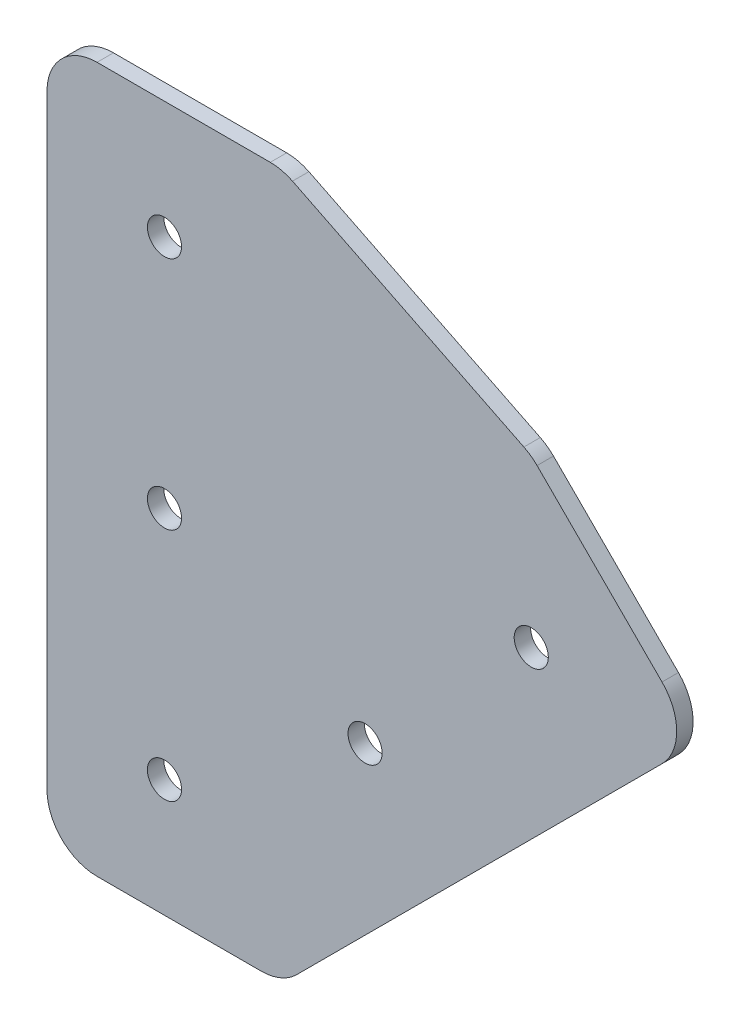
ISO-10303-21;
HEADER;
FILE_DESCRIPTION(('STEP AP214'),'2;1');
FILE_NAME('part.step','',(''),(''),'','','');
FILE_SCHEMA(('AUTOMOTIVE_DESIGN { 1 0 10303 214 1 1 1 1 }'));
ENDSEC;
DATA;
#1=APPLICATION_CONTEXT('core data for automotive mechanical design processes');
#2=APPLICATION_PROTOCOL_DEFINITION('international standard','automotive_design',2000,#1);
#3=PRODUCT_CONTEXT('',#1,'mechanical');
#4=PRODUCT('Part','Part','',(#3));
#5=PRODUCT_RELATED_PRODUCT_CATEGORY('part','',(#4));
#6=PRODUCT_DEFINITION_FORMATION('','',#4);
#7=PRODUCT_DEFINITION_CONTEXT('part definition',#1,'design');
#8=PRODUCT_DEFINITION('design','',#6,#7);
#9=PRODUCT_DEFINITION_SHAPE('','',#8);
#10=(LENGTH_UNIT() NAMED_UNIT(*) SI_UNIT(.MILLI.,.METRE.));
#11=(NAMED_UNIT(*) PLANE_ANGLE_UNIT() SI_UNIT($,.RADIAN.));
#12=(NAMED_UNIT(*) SI_UNIT($,.STERADIAN.) SOLID_ANGLE_UNIT());
#13=UNCERTAINTY_MEASURE_WITH_UNIT(LENGTH_MEASURE(1.E-05),#10,'distance_accuracy_value','');
#14=(GEOMETRIC_REPRESENTATION_CONTEXT(3) GLOBAL_UNCERTAINTY_ASSIGNED_CONTEXT((#13)) GLOBAL_UNIT_ASSIGNED_CONTEXT((#10,
#11,#12)) REPRESENTATION_CONTEXT('',''));
#15=CARTESIAN_POINT('',(0.,0.,0.));
#16=DIRECTION('',(0.,0.,1.));
#17=DIRECTION('',(1.,0.,0.));
#18=AXIS2_PLACEMENT_3D('',#15,#16,#17);
#19=CARTESIAN_POINT('',(0.,0.,1.5875));
#20=DIRECTION('',(0.,0.,1.));
#21=DIRECTION('',(1.,0.,0.));
#22=AXIS2_PLACEMENT_3D('',#19,#20,#21);
#23=PLANE('',#22);
#24=DIRECTION('',(-0.707106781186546,-0.707106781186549,0.));
#25=VECTOR('',#24,1.);
#26=CARTESIAN_POINT('',(22.733,0.,1.5875));
#27=LINE('',#26,#25);
#28=CARTESIAN_POINT('',(24.1511523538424,1.41815235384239,1.5875));
#29=VERTEX_POINT('',#28);
#30=CARTESIAN_POINT('',(59.4959234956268,36.7629234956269,1.5875));
#31=VERTEX_POINT('',#30);
#32=EDGE_CURVE('E139',#29,#31,#27,.F.);
#33=ORIENTED_EDGE('',*,*,#32,.T.);
#34=CARTESIAN_POINT('',(56.0722008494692,40.1866461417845,1.5875));
#35=DIRECTION('',(0.,0.,-1.));
#36=DIRECTION('',(-1.,0.,0.));
#37=AXIS2_PLACEMENT_3D('',#34,#35,#36);
#38=CIRCLE('',#37,4.841875);
#39=CARTESIAN_POINT('',(59.4959234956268,43.6103687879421,1.5875));
#40=VERTEX_POINT('',#39);
#41=EDGE_CURVE('E141',#40,#31,#38,.T.);
#42=ORIENTED_EDGE('',*,*,#41,.F.);
#43=DIRECTION('',(0.707106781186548,-0.707106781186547,0.));
#44=VECTOR('',#43,1.);
#45=CARTESIAN_POINT('',(62.9196461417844,40.1866461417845,1.5875));
#46=LINE('',#45,#44);
#47=CARTESIAN_POINT('',(47.4074930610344,55.6987992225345,1.5875));
#48=VERTEX_POINT('',#47);
#49=EDGE_CURVE('E134',#40,#48,#46,.F.);
#50=ORIENTED_EDGE('',*,*,#49,.T.);
#51=CARTESIAN_POINT('',(43.9837704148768,52.2750765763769,1.5875));
#52=DIRECTION('',(0.,0.,-1.));
#53=DIRECTION('',(-1.,0.,0.));
#54=AXIS2_PLACEMENT_3D('',#51,#52,#53);
#55=CIRCLE('',#54,4.841875);
#56=CARTESIAN_POINT('',(46.1320748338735,56.6142633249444,1.5875));
#57=VERTEX_POINT('',#56);
#58=EDGE_CURVE('E137',#57,#48,#55,.T.);
#59=ORIENTED_EDGE('',*,*,#58,.F.);
#60=DIRECTION('',(0.896179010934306,-0.443692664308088,0.));
#61=VECTOR('',#60,1.);
#62=CARTESIAN_POINT('',(22.733,68.199,1.5875));
#63=LINE('',#62,#61);
#64=CARTESIAN_POINT('',(23.7483394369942,67.6963117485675,1.5875));
#65=VERTEX_POINT('',#64);
#66=EDGE_CURVE('E110',#57,#65,#63,.F.);
#67=ORIENTED_EDGE('',*,*,#66,.T.);
#68=CARTESIAN_POINT('',(21.6000350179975,63.357125,1.5875));
#69=DIRECTION('',(0.,0.,-1.));
#70=DIRECTION('',(-1.,0.,0.));
#71=AXIS2_PLACEMENT_3D('',#68,#69,#70);
#72=CIRCLE('',#71,4.841875);
#73=CARTESIAN_POINT('',(21.6000350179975,68.199,1.5875));
#74=VERTEX_POINT('',#73);
#75=EDGE_CURVE('E104',#74,#65,#72,.T.);
#76=ORIENTED_EDGE('',*,*,#75,.F.);
#77=DIRECTION('',(1.,0.,0.));
#78=VECTOR('',#77,1.);
#79=CARTESIAN_POINT('',(0.,68.199,1.5875));
#80=LINE('',#79,#78);
#81=CARTESIAN_POINT('',(4.841875,68.199,1.5875));
#82=VERTEX_POINT('',#81);
#83=EDGE_CURVE('E108',#74,#82,#80,.F.);
#84=ORIENTED_EDGE('',*,*,#83,.T.);
#85=CARTESIAN_POINT('',(4.841875,63.357125,1.5875));
#86=DIRECTION('',(0.,0.,-1.));
#87=DIRECTION('',(-1.,0.,0.));
#88=AXIS2_PLACEMENT_3D('',#85,#86,#87);
#89=CIRCLE('',#88,4.841875);
#90=CARTESIAN_POINT('',(0.,63.357125,1.5875));
#91=VERTEX_POINT('',#90);
#92=EDGE_CURVE('E123',#91,#82,#89,.T.);
#93=ORIENTED_EDGE('',*,*,#92,.F.);
#94=DIRECTION('',(0.,1.,0.));
#95=VECTOR('',#94,1.);
#96=CARTESIAN_POINT('',(0.,68.199,1.5875));
#97=LINE('',#96,#95);
#98=CARTESIAN_POINT('',(0.,4.841875,1.5875));
#99=VERTEX_POINT('',#98);
#100=EDGE_CURVE('E148',#91,#99,#97,.F.);
#101=ORIENTED_EDGE('',*,*,#100,.T.);
#102=CARTESIAN_POINT('',(4.841875,4.841875,1.5875));
#103=DIRECTION('',(0.,0.,-1.));
#104=DIRECTION('',(-1.,0.,0.));
#105=AXIS2_PLACEMENT_3D('',#102,#103,#104);
#106=CIRCLE('',#105,4.841875);
#107=CARTESIAN_POINT('',(4.841875,0.,1.5875));
#108=VERTEX_POINT('',#107);
#109=EDGE_CURVE('E150',#108,#99,#106,.T.);
#110=ORIENTED_EDGE('',*,*,#109,.F.);
#111=DIRECTION('',(1.,0.,0.));
#112=VECTOR('',#111,1.);
#113=CARTESIAN_POINT('',(0.,0.,1.5875));
#114=LINE('',#113,#112);
#115=CARTESIAN_POINT('',(20.7274297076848,0.,1.5875));
#116=VERTEX_POINT('',#115);
#117=EDGE_CURVE('E143',#108,#116,#114,.T.);
#118=ORIENTED_EDGE('',*,*,#117,.T.);
#119=CARTESIAN_POINT('',(20.7274297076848,4.841875,1.5875));
#120=DIRECTION('',(0.,0.,-1.));
#121=DIRECTION('',(-1.,0.,0.));
#122=AXIS2_PLACEMENT_3D('',#119,#120,#121);
#123=CIRCLE('',#122,4.841875);
#124=EDGE_CURVE('E146',#29,#116,#123,.T.);
#125=ORIENTED_EDGE('',*,*,#124,.F.);
#126=EDGE_LOOP('',(#33,#42,#50,#59,#67,#76,#84,#93,#101,#110,#118,#125));
#127=FACE_BOUND('',#126,.T.);
#128=CARTESIAN_POINT('',(11.3665,34.0995,1.5875));
#129=DIRECTION('',(0.,0.,1.));
#130=DIRECTION('',(1.,0.,0.));
#131=AXIS2_PLACEMENT_3D('',#128,#129,#130);
#132=CIRCLE('',#131,1.651);
#133=CARTESIAN_POINT('',(13.0175,34.0995,1.5875));
#134=VERTEX_POINT('',#133);
#135=EDGE_CURVE('E116',#134,#134,#132,.F.);
#136=ORIENTED_EDGE('',*,*,#135,.T.);
#137=EDGE_LOOP('',(#136));
#138=FACE_BOUND('',#137,.T.);
#139=CARTESIAN_POINT('',(11.3665,11.3665,1.5875));
#140=DIRECTION('',(0.,0.,1.));
#141=DIRECTION('',(1.,0.,0.));
#142=AXIS2_PLACEMENT_3D('',#139,#140,#141);
#143=CIRCLE('',#142,1.651);
#144=CARTESIAN_POINT('',(13.0175,11.3665,1.5875));
#145=VERTEX_POINT('',#144);
#146=EDGE_CURVE('E198',#145,#145,#143,.F.);
#147=ORIENTED_EDGE('',*,*,#146,.T.);
#148=EDGE_LOOP('',(#147));
#149=FACE_BOUND('',#148,.T.);
#150=CARTESIAN_POINT('',(30.7703292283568,24.1119876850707,1.5875));
#151=DIRECTION('',(0.,0.,1.));
#152=DIRECTION('',(1.,0.,0.));
#153=AXIS2_PLACEMENT_3D('',#150,#151,#152);
#154=CIRCLE('',#153,1.651);
#155=CARTESIAN_POINT('',(32.4213292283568,24.1119876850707,1.5875));
#156=VERTEX_POINT('',#155);
#157=EDGE_CURVE('E201',#156,#156,#154,.F.);
#158=ORIENTED_EDGE('',*,*,#157,.T.);
#159=EDGE_LOOP('',(#158));
#160=FACE_BOUND('',#159,.T.);
#161=CARTESIAN_POINT('',(46.8449876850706,40.1866461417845,1.5875));
#162=DIRECTION('',(0.,0.,1.));
#163=DIRECTION('',(1.,0.,0.));
#164=AXIS2_PLACEMENT_3D('',#161,#162,#163);
#165=CIRCLE('',#164,1.651);
#166=CARTESIAN_POINT('',(48.4959876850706,40.1866461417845,1.5875));
#167=VERTEX_POINT('',#166);
#168=EDGE_CURVE('E203',#167,#167,#165,.F.);
#169=ORIENTED_EDGE('',*,*,#168,.T.);
#170=EDGE_LOOP('',(#169));
#171=FACE_BOUND('',#170,.T.);
#172=CARTESIAN_POINT('',(11.3665,56.8325,1.5875));
#173=DIRECTION('',(0.,0.,1.));
#174=DIRECTION('',(1.,0.,0.));
#175=AXIS2_PLACEMENT_3D('',#172,#173,#174);
#176=CIRCLE('',#175,1.651);
#177=CARTESIAN_POINT('',(13.0175,56.8325,1.5875));
#178=VERTEX_POINT('',#177);
#179=EDGE_CURVE('E20',#178,#178,#176,.F.);
#180=ORIENTED_EDGE('',*,*,#179,.T.);
#181=EDGE_LOOP('',(#180));
#182=FACE_BOUND('',#181,.T.);
#183=ADVANCED_FACE('F17',(#127,#138,#149,#160,#171,#182),#23,.T.);
#184=CARTESIAN_POINT('',(11.3665,56.8325,1.5875));
#185=DIRECTION('',(0.,0.,1.));
#186=DIRECTION('',(1.,0.,0.));
#187=AXIS2_PLACEMENT_3D('',#184,#185,#186);
#188=CYLINDRICAL_SURFACE('',#187,1.651);
#189=CARTESIAN_POINT('',(11.3665,56.8325,0.));
#190=DIRECTION('',(0.,0.,1.));
#191=DIRECTION('',(1.,0.,0.));
#192=AXIS2_PLACEMENT_3D('',#189,#190,#191);
#193=CIRCLE('',#192,1.651);
#194=CARTESIAN_POINT('',(13.0175,56.8325,0.));
#195=VERTEX_POINT('',#194);
#196=EDGE_CURVE('E133',#195,#195,#193,.F.);
#197=ORIENTED_EDGE('',*,*,#196,.T.);
#198=EDGE_LOOP('',(#197));
#199=FACE_BOUND('',#198,.T.);
#200=ORIENTED_EDGE('',*,*,#179,.F.);
#201=EDGE_LOOP('',(#200));
#202=FACE_BOUND('',#201,.T.);
#203=ADVANCED_FACE('F211',(#199,#202),#188,.F.);
#204=CARTESIAN_POINT('',(46.8449876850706,40.1866461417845,1.5875));
#205=DIRECTION('',(0.,0.,1.));
#206=DIRECTION('',(1.,0.,0.));
#207=AXIS2_PLACEMENT_3D('',#204,#205,#206);
#208=CYLINDRICAL_SURFACE('',#207,1.651);
#209=CARTESIAN_POINT('',(46.8449876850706,40.1866461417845,0.));
#210=DIRECTION('',(0.,0.,1.));
#211=DIRECTION('',(1.,0.,0.));
#212=AXIS2_PLACEMENT_3D('',#209,#210,#211);
#213=CIRCLE('',#212,1.651);
#214=CARTESIAN_POINT('',(48.4959876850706,40.1866461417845,0.));
#215=VERTEX_POINT('',#214);
#216=EDGE_CURVE('E182',#215,#215,#213,.F.);
#217=ORIENTED_EDGE('',*,*,#216,.T.);
#218=EDGE_LOOP('',(#217));
#219=FACE_BOUND('',#218,.T.);
#220=ORIENTED_EDGE('',*,*,#168,.F.);
#221=EDGE_LOOP('',(#220));
#222=FACE_BOUND('',#221,.T.);
#223=ADVANCED_FACE('F213',(#219,#222),#208,.F.);
#224=CARTESIAN_POINT('',(30.7703292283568,24.1119876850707,1.5875));
#225=DIRECTION('',(0.,0.,1.));
#226=DIRECTION('',(1.,0.,0.));
#227=AXIS2_PLACEMENT_3D('',#224,#225,#226);
#228=CYLINDRICAL_SURFACE('',#227,1.651);
#229=CARTESIAN_POINT('',(30.7703292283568,24.1119876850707,0.));
#230=DIRECTION('',(0.,0.,1.));
#231=DIRECTION('',(1.,0.,0.));
#232=AXIS2_PLACEMENT_3D('',#229,#230,#231);
#233=CIRCLE('',#232,1.651);
#234=CARTESIAN_POINT('',(32.4213292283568,24.1119876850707,0.));
#235=VERTEX_POINT('',#234);
#236=EDGE_CURVE('E179',#235,#235,#233,.F.);
#237=ORIENTED_EDGE('',*,*,#236,.T.);
#238=EDGE_LOOP('',(#237));
#239=FACE_BOUND('',#238,.T.);
#240=ORIENTED_EDGE('',*,*,#157,.F.);
#241=EDGE_LOOP('',(#240));
#242=FACE_BOUND('',#241,.T.);
#243=ADVANCED_FACE('F220',(#239,#242),#228,.F.);
#244=CARTESIAN_POINT('',(11.3665,11.3665,1.5875));
#245=DIRECTION('',(0.,0.,1.));
#246=DIRECTION('',(1.,0.,0.));
#247=AXIS2_PLACEMENT_3D('',#244,#245,#246);
#248=CYLINDRICAL_SURFACE('',#247,1.651);
#249=CARTESIAN_POINT('',(11.3665,11.3665,0.));
#250=DIRECTION('',(0.,0.,1.));
#251=DIRECTION('',(1.,0.,0.));
#252=AXIS2_PLACEMENT_3D('',#249,#250,#251);
#253=CIRCLE('',#252,1.651);
#254=CARTESIAN_POINT('',(13.0175,11.3665,0.));
#255=VERTEX_POINT('',#254);
#256=EDGE_CURVE('E176',#255,#255,#253,.F.);
#257=ORIENTED_EDGE('',*,*,#256,.T.);
#258=EDGE_LOOP('',(#257));
#259=FACE_BOUND('',#258,.T.);
#260=ORIENTED_EDGE('',*,*,#146,.F.);
#261=EDGE_LOOP('',(#260));
#262=FACE_BOUND('',#261,.T.);
#263=ADVANCED_FACE('F278',(#259,#262),#248,.F.);
#264=CARTESIAN_POINT('',(11.3665,34.0995,1.5875));
#265=DIRECTION('',(0.,0.,1.));
#266=DIRECTION('',(1.,0.,0.));
#267=AXIS2_PLACEMENT_3D('',#264,#265,#266);
#268=CYLINDRICAL_SURFACE('',#267,1.651);
#269=CARTESIAN_POINT('',(11.3665,34.0995,0.));
#270=DIRECTION('',(0.,0.,1.));
#271=DIRECTION('',(1.,0.,0.));
#272=AXIS2_PLACEMENT_3D('',#269,#270,#271);
#273=CIRCLE('',#272,1.651);
#274=CARTESIAN_POINT('',(13.0175,34.0995,0.));
#275=VERTEX_POINT('',#274);
#276=EDGE_CURVE('E173',#275,#275,#273,.F.);
#277=ORIENTED_EDGE('',*,*,#276,.T.);
#278=EDGE_LOOP('',(#277));
#279=FACE_BOUND('',#278,.T.);
#280=ORIENTED_EDGE('',*,*,#135,.F.);
#281=EDGE_LOOP('',(#280));
#282=FACE_BOUND('',#281,.T.);
#283=ADVANCED_FACE('F275',(#279,#282),#268,.F.);
#284=CARTESIAN_POINT('',(21.6000350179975,63.357125,1.5875));
#285=DIRECTION('',(0.,0.,-1.));
#286=DIRECTION('',(-1.,0.,0.));
#287=AXIS2_PLACEMENT_3D('',#284,#285,#286);
#288=CYLINDRICAL_SURFACE('',#287,4.841875);
#289=CARTESIAN_POINT('',(21.6000350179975,63.357125,0.));
#290=DIRECTION('',(0.,0.,-1.));
#291=DIRECTION('',(-1.,0.,0.));
#292=AXIS2_PLACEMENT_3D('',#289,#290,#291);
#293=CIRCLE('',#292,4.841875);
#294=CARTESIAN_POINT('',(23.7483394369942,67.6963117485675,0.));
#295=VERTEX_POINT('',#294);
#296=CARTESIAN_POINT('',(21.6000350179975,68.199,0.));
#297=VERTEX_POINT('',#296);
#298=EDGE_CURVE('E127',#295,#297,#293,.F.);
#299=ORIENTED_EDGE('',*,*,#298,.T.);
#300=DIRECTION('',(0.,0.,1.));
#301=VECTOR('',#300,1.);
#302=CARTESIAN_POINT('',(21.6000350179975,68.199,1.5875));
#303=LINE('',#302,#301);
#304=EDGE_CURVE('E115',#297,#74,#303,.T.);
#305=ORIENTED_EDGE('',*,*,#304,.T.);
#306=ORIENTED_EDGE('',*,*,#75,.T.);
#307=DIRECTION('',(0.,0.,1.));
#308=VECTOR('',#307,1.);
#309=CARTESIAN_POINT('',(23.7483394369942,67.6963117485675,1.5875));
#310=LINE('',#309,#308);
#311=EDGE_CURVE('E433',#65,#295,#310,.F.);
#312=ORIENTED_EDGE('',*,*,#311,.T.);
#313=EDGE_LOOP('',(#299,#305,#306,#312));
#314=FACE_BOUND('',#313,.T.);
#315=ADVANCED_FACE('F126',(#314),#288,.T.);
#316=CARTESIAN_POINT('',(0.,68.199,1.5875));
#317=DIRECTION('',(0.,-1.,0.));
#318=DIRECTION('',(1.,0.,0.));
#319=AXIS2_PLACEMENT_3D('',#316,#317,#318);
#320=PLANE('',#319);
#321=ORIENTED_EDGE('',*,*,#304,.F.);
#322=DIRECTION('',(1.,0.,0.));
#323=VECTOR('',#322,1.);
#324=CARTESIAN_POINT('',(0.,68.199,0.));
#325=LINE('',#324,#323);
#326=CARTESIAN_POINT('',(4.841875,68.199,0.));
#327=VERTEX_POINT('',#326);
#328=EDGE_CURVE('E171',#297,#327,#325,.F.);
#329=ORIENTED_EDGE('',*,*,#328,.T.);
#330=DIRECTION('',(0.,0.,-1.));
#331=VECTOR('',#330,1.);
#332=CARTESIAN_POINT('',(4.841875,68.199,1.5875));
#333=LINE('',#332,#331);
#334=EDGE_CURVE('E122',#82,#327,#333,.T.);
#335=ORIENTED_EDGE('',*,*,#334,.F.);
#336=ORIENTED_EDGE('',*,*,#83,.F.);
#337=EDGE_LOOP('',(#321,#329,#335,#336));
#338=FACE_BOUND('',#337,.T.);
#339=ADVANCED_FACE('F119',(#338),#320,.F.);
#340=CARTESIAN_POINT('',(4.841875,63.357125,1.5875));
#341=DIRECTION('',(0.,0.,-1.));
#342=DIRECTION('',(-1.,0.,0.));
#343=AXIS2_PLACEMENT_3D('',#340,#341,#342);
#344=CYLINDRICAL_SURFACE('',#343,4.841875);
#345=CARTESIAN_POINT('',(4.841875,63.357125,0.));
#346=DIRECTION('',(0.,0.,-1.));
#347=DIRECTION('',(-1.,0.,0.));
#348=AXIS2_PLACEMENT_3D('',#345,#346,#347);
#349=CIRCLE('',#348,4.841875);
#350=CARTESIAN_POINT('',(0.,63.357125,0.));
#351=VERTEX_POINT('',#350);
#352=EDGE_CURVE('E168',#327,#351,#349,.F.);
#353=ORIENTED_EDGE('',*,*,#352,.T.);
#354=DIRECTION('',(0.,0.,-1.));
#355=VECTOR('',#354,1.);
#356=CARTESIAN_POINT('',(0.,63.357125,1.5875));
#357=LINE('',#356,#355);
#358=EDGE_CURVE('E151',#351,#91,#357,.F.);
#359=ORIENTED_EDGE('',*,*,#358,.T.);
#360=ORIENTED_EDGE('',*,*,#92,.T.);
#361=ORIENTED_EDGE('',*,*,#334,.T.);
#362=EDGE_LOOP('',(#353,#359,#360,#361));
#363=FACE_BOUND('',#362,.T.);
#364=ADVANCED_FACE('F266',(#363),#344,.T.);
#365=CARTESIAN_POINT('',(0.,68.199,1.5875));
#366=DIRECTION('',(1.,0.,0.));
#367=DIRECTION('',(0.,0.,-1.));
#368=AXIS2_PLACEMENT_3D('',#365,#366,#367);
#369=PLANE('',#368);
#370=DIRECTION('',(0.,0.,-1.));
#371=VECTOR('',#370,1.);
#372=CARTESIAN_POINT('',(0.,4.841875,1.5875));
#373=LINE('',#372,#371);
#374=CARTESIAN_POINT('',(0.,4.841875,0.));
#375=VERTEX_POINT('',#374);
#376=EDGE_CURVE('E194',#99,#375,#373,.T.);
#377=ORIENTED_EDGE('',*,*,#376,.F.);
#378=ORIENTED_EDGE('',*,*,#100,.F.);
#379=ORIENTED_EDGE('',*,*,#358,.F.);
#380=DIRECTION('',(0.,1.,0.));
#381=VECTOR('',#380,1.);
#382=CARTESIAN_POINT('',(0.,0.,0.));
#383=LINE('',#382,#381);
#384=EDGE_CURVE('E167',#351,#375,#383,.F.);
#385=ORIENTED_EDGE('',*,*,#384,.T.);
#386=EDGE_LOOP('',(#377,#378,#379,#385));
#387=FACE_BOUND('',#386,.T.);
#388=ADVANCED_FACE('F262',(#387),#369,.F.);
#389=CARTESIAN_POINT('',(4.841875,4.841875,1.5875));
#390=DIRECTION('',(0.,0.,-1.));
#391=DIRECTION('',(-1.,0.,0.));
#392=AXIS2_PLACEMENT_3D('',#389,#390,#391);
#393=CYLINDRICAL_SURFACE('',#392,4.841875);
#394=CARTESIAN_POINT('',(4.841875,4.841875,0.));
#395=DIRECTION('',(0.,0.,-1.));
#396=DIRECTION('',(-1.,0.,0.));
#397=AXIS2_PLACEMENT_3D('',#394,#395,#396);
#398=CIRCLE('',#397,4.841875);
#399=CARTESIAN_POINT('',(4.841875,0.,0.));
#400=VERTEX_POINT('',#399);
#401=EDGE_CURVE('E164',#375,#400,#398,.F.);
#402=ORIENTED_EDGE('',*,*,#401,.T.);
#403=DIRECTION('',(0.,0.,1.));
#404=VECTOR('',#403,1.);
#405=CARTESIAN_POINT('',(4.841875,0.,1.5875));
#406=LINE('',#405,#404);
#407=EDGE_CURVE('E147',#400,#108,#406,.T.);
#408=ORIENTED_EDGE('',*,*,#407,.T.);
#409=ORIENTED_EDGE('',*,*,#109,.T.);
#410=ORIENTED_EDGE('',*,*,#376,.T.);
#411=EDGE_LOOP('',(#402,#408,#409,#410));
#412=FACE_BOUND('',#411,.T.);
#413=ADVANCED_FACE('F258',(#412),#393,.T.);
#414=CARTESIAN_POINT('',(0.,0.,1.5875));
#415=DIRECTION('',(0.,1.,0.));
#416=DIRECTION('',(0.,0.,1.));
#417=AXIS2_PLACEMENT_3D('',#414,#415,#416);
#418=PLANE('',#417);
#419=ORIENTED_EDGE('',*,*,#407,.F.);
#420=DIRECTION('',(1.,0.,0.));
#421=VECTOR('',#420,1.);
#422=CARTESIAN_POINT('',(0.,0.,0.));
#423=LINE('',#422,#421);
#424=CARTESIAN_POINT('',(20.7274297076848,0.,0.));
#425=VERTEX_POINT('',#424);
#426=EDGE_CURVE('E163',#400,#425,#423,.T.);
#427=ORIENTED_EDGE('',*,*,#426,.T.);
#428=DIRECTION('',(0.,0.,-1.));
#429=VECTOR('',#428,1.);
#430=CARTESIAN_POINT('',(20.7274297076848,0.,1.5875));
#431=LINE('',#430,#429);
#432=EDGE_CURVE('E192',#116,#425,#431,.T.);
#433=ORIENTED_EDGE('',*,*,#432,.F.);
#434=ORIENTED_EDGE('',*,*,#117,.F.);
#435=EDGE_LOOP('',(#419,#427,#433,#434));
#436=FACE_BOUND('',#435,.T.);
#437=ADVANCED_FACE('F254',(#436),#418,.F.);
#438=CARTESIAN_POINT('',(20.7274297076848,4.841875,1.5875));
#439=DIRECTION('',(0.,0.,-1.));
#440=DIRECTION('',(-1.,0.,0.));
#441=AXIS2_PLACEMENT_3D('',#438,#439,#440);
#442=CYLINDRICAL_SURFACE('',#441,4.841875);
#443=CARTESIAN_POINT('',(20.7274297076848,4.841875,0.));
#444=DIRECTION('',(0.,0.,-1.));
#445=DIRECTION('',(-1.,0.,0.));
#446=AXIS2_PLACEMENT_3D('',#443,#444,#445);
#447=CIRCLE('',#446,4.841875);
#448=CARTESIAN_POINT('',(24.1511523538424,1.41815235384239,0.));
#449=VERTEX_POINT('',#448);
#450=EDGE_CURVE('E160',#425,#449,#447,.F.);
#451=ORIENTED_EDGE('',*,*,#450,.T.);
#452=DIRECTION('',(0.,0.,1.));
#453=VECTOR('',#452,1.);
#454=CARTESIAN_POINT('',(24.1511523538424,1.41815235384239,1.5875));
#455=LINE('',#454,#453);
#456=EDGE_CURVE('E142',#449,#29,#455,.T.);
#457=ORIENTED_EDGE('',*,*,#456,.T.);
#458=ORIENTED_EDGE('',*,*,#124,.T.);
#459=ORIENTED_EDGE('',*,*,#432,.T.);
#460=EDGE_LOOP('',(#451,#457,#458,#459));
#461=FACE_BOUND('',#460,.T.);
#462=ADVANCED_FACE('F250',(#461),#442,.T.);
#463=CARTESIAN_POINT('',(22.733,0.,1.5875));
#464=DIRECTION('',(-0.707106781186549,0.707106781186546,0.));
#465=DIRECTION('',(-0.707106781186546,-0.707106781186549,0.));
#466=AXIS2_PLACEMENT_3D('',#463,#464,#465);
#467=PLANE('',#466);
#468=ORIENTED_EDGE('',*,*,#456,.F.);
#469=DIRECTION('',(0.707106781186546,0.707106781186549,0.));
#470=VECTOR('',#469,1.);
#471=CARTESIAN_POINT('',(24.1511523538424,1.41815235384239,0.));
#472=LINE('',#471,#470);
#473=CARTESIAN_POINT('',(59.4959234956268,36.7629234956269,0.));
#474=VERTEX_POINT('',#473);
#475=EDGE_CURVE('E159',#449,#474,#472,.T.);
#476=ORIENTED_EDGE('',*,*,#475,.T.);
#477=DIRECTION('',(0.,0.,-1.));
#478=VECTOR('',#477,1.);
#479=CARTESIAN_POINT('',(59.4959234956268,36.7629234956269,1.5875));
#480=LINE('',#479,#478);
#481=EDGE_CURVE('E190',#31,#474,#480,.T.);
#482=ORIENTED_EDGE('',*,*,#481,.F.);
#483=ORIENTED_EDGE('',*,*,#32,.F.);
#484=EDGE_LOOP('',(#468,#476,#482,#483));
#485=FACE_BOUND('',#484,.T.);
#486=ADVANCED_FACE('F246',(#485),#467,.F.);
#487=CARTESIAN_POINT('',(56.0722008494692,40.1866461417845,1.5875));
#488=DIRECTION('',(0.,0.,-1.));
#489=DIRECTION('',(-1.,0.,0.));
#490=AXIS2_PLACEMENT_3D('',#487,#488,#489);
#491=CYLINDRICAL_SURFACE('',#490,4.841875);
#492=CARTESIAN_POINT('',(56.0722008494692,40.1866461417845,0.));
#493=DIRECTION('',(0.,0.,-1.));
#494=DIRECTION('',(-1.,0.,0.));
#495=AXIS2_PLACEMENT_3D('',#492,#493,#494);
#496=CIRCLE('',#495,4.841875);
#497=CARTESIAN_POINT('',(59.4959234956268,43.6103687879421,0.));
#498=VERTEX_POINT('',#497);
#499=EDGE_CURVE('E156',#474,#498,#496,.F.);
#500=ORIENTED_EDGE('',*,*,#499,.T.);
#501=DIRECTION('',(0.,0.,1.));
#502=VECTOR('',#501,1.);
#503=CARTESIAN_POINT('',(59.4959234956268,43.6103687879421,1.5875));
#504=LINE('',#503,#502);
#505=EDGE_CURVE('E138',#498,#40,#504,.T.);
#506=ORIENTED_EDGE('',*,*,#505,.T.);
#507=ORIENTED_EDGE('',*,*,#41,.T.);
#508=ORIENTED_EDGE('',*,*,#481,.T.);
#509=EDGE_LOOP('',(#500,#506,#507,#508));
#510=FACE_BOUND('',#509,.T.);
#511=ADVANCED_FACE('F242',(#510),#491,.T.);
#512=CARTESIAN_POINT('',(62.9196461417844,40.1866461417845,1.5875));
#513=DIRECTION('',(-0.707106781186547,-0.707106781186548,0.));
#514=DIRECTION('',(0.707106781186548,-0.707106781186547,0.));
#515=AXIS2_PLACEMENT_3D('',#512,#513,#514);
#516=PLANE('',#515);
#517=DIRECTION('',(0.,0.,-1.));
#518=VECTOR('',#517,1.);
#519=CARTESIAN_POINT('',(47.4074930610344,55.6987992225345,1.5875));
#520=LINE('',#519,#518);
#521=CARTESIAN_POINT('',(47.4074930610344,55.6987992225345,0.));
#522=VERTEX_POINT('',#521);
#523=EDGE_CURVE('E188',#48,#522,#520,.T.);
#524=ORIENTED_EDGE('',*,*,#523,.F.);
#525=ORIENTED_EDGE('',*,*,#49,.F.);
#526=ORIENTED_EDGE('',*,*,#505,.F.);
#527=DIRECTION('',(-0.707106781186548,0.707106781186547,0.));
#528=VECTOR('',#527,1.);
#529=CARTESIAN_POINT('',(59.4959234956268,43.6103687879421,0.));
#530=LINE('',#529,#528);
#531=EDGE_CURVE('E155',#498,#522,#530,.T.);
#532=ORIENTED_EDGE('',*,*,#531,.T.);
#533=EDGE_LOOP('',(#524,#525,#526,#532));
#534=FACE_BOUND('',#533,.T.);
#535=ADVANCED_FACE('F238',(#534),#516,.F.);
#536=CARTESIAN_POINT('',(43.9837704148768,52.2750765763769,1.5875));
#537=DIRECTION('',(0.,0.,-1.));
#538=DIRECTION('',(-1.,0.,0.));
#539=AXIS2_PLACEMENT_3D('',#536,#537,#538);
#540=CYLINDRICAL_SURFACE('',#539,4.841875);
#541=CARTESIAN_POINT('',(43.9837704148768,52.2750765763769,0.));
#542=DIRECTION('',(0.,0.,-1.));
#543=DIRECTION('',(-1.,0.,0.));
#544=AXIS2_PLACEMENT_3D('',#541,#542,#543);
#545=CIRCLE('',#544,4.841875);
#546=CARTESIAN_POINT('',(46.1320748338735,56.6142633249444,0.));
#547=VERTEX_POINT('',#546);
#548=EDGE_CURVE('E26',#522,#547,#545,.F.);
#549=ORIENTED_EDGE('',*,*,#548,.T.);
#550=DIRECTION('',(0.,0.,1.));
#551=VECTOR('',#550,1.);
#552=CARTESIAN_POINT('',(46.1320748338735,56.6142633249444,1.5875));
#553=LINE('',#552,#551);
#554=EDGE_CURVE('E34',#547,#57,#553,.T.);
#555=ORIENTED_EDGE('',*,*,#554,.T.);
#556=ORIENTED_EDGE('',*,*,#58,.T.);
#557=ORIENTED_EDGE('',*,*,#523,.T.);
#558=EDGE_LOOP('',(#549,#555,#556,#557));
#559=FACE_BOUND('',#558,.T.);
#560=ADVANCED_FACE('F231',(#559),#540,.T.);
#561=CARTESIAN_POINT('',(22.733,68.199,1.5875));
#562=DIRECTION('',(-0.443692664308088,-0.896179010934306,0.));
#563=DIRECTION('',(0.896179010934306,-0.443692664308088,0.));
#564=AXIS2_PLACEMENT_3D('',#561,#562,#563);
#565=PLANE('',#564);
#566=ORIENTED_EDGE('',*,*,#554,.F.);
#567=DIRECTION('',(-0.896179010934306,0.443692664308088,0.));
#568=VECTOR('',#567,1.);
#569=CARTESIAN_POINT('',(46.1320748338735,56.6142633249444,0.));
#570=LINE('',#569,#568);
#571=EDGE_CURVE('E10',#547,#295,#570,.T.);
#572=ORIENTED_EDGE('',*,*,#571,.T.);
#573=ORIENTED_EDGE('',*,*,#311,.F.);
#574=ORIENTED_EDGE('',*,*,#66,.F.);
#575=EDGE_LOOP('',(#566,#572,#573,#574));
#576=FACE_BOUND('',#575,.T.);
#577=ADVANCED_FACE('F225',(#576),#565,.F.);
#578=CARTESIAN_POINT('',(0.,0.,0.));
#579=DIRECTION('',(0.,0.,1.));
#580=DIRECTION('',(1.,0.,0.));
#581=AXIS2_PLACEMENT_3D('',#578,#579,#580);
#582=PLANE('',#581);
#583=ORIENTED_EDGE('',*,*,#548,.F.);
#584=ORIENTED_EDGE('',*,*,#531,.F.);
#585=ORIENTED_EDGE('',*,*,#499,.F.);
#586=ORIENTED_EDGE('',*,*,#475,.F.);
#587=ORIENTED_EDGE('',*,*,#450,.F.);
#588=ORIENTED_EDGE('',*,*,#426,.F.);
#589=ORIENTED_EDGE('',*,*,#401,.F.);
#590=ORIENTED_EDGE('',*,*,#384,.F.);
#591=ORIENTED_EDGE('',*,*,#352,.F.);
#592=ORIENTED_EDGE('',*,*,#328,.F.);
#593=ORIENTED_EDGE('',*,*,#298,.F.);
#594=ORIENTED_EDGE('',*,*,#571,.F.);
#595=EDGE_LOOP('',(#583,#584,#585,#586,#587,#588,#589,#590,#591,#592,#593,#594));
#596=FACE_BOUND('',#595,.T.);
#597=ORIENTED_EDGE('',*,*,#276,.F.);
#598=EDGE_LOOP('',(#597));
#599=FACE_BOUND('',#598,.T.);
#600=ORIENTED_EDGE('',*,*,#256,.F.);
#601=EDGE_LOOP('',(#600));
#602=FACE_BOUND('',#601,.T.);
#603=ORIENTED_EDGE('',*,*,#236,.F.);
#604=EDGE_LOOP('',(#603));
#605=FACE_BOUND('',#604,.T.);
#606=ORIENTED_EDGE('',*,*,#216,.F.);
#607=EDGE_LOOP('',(#606));
#608=FACE_BOUND('',#607,.T.);
#609=ORIENTED_EDGE('',*,*,#196,.F.);
#610=EDGE_LOOP('',(#609));
#611=FACE_BOUND('',#610,.T.);
#612=ADVANCED_FACE('F223',(#596,#599,#602,#605,#608,#611),#582,.F.);
#613=CLOSED_SHELL('',(#183,#203,#223,#243,#263,#283,#315,#339,#364,#388,#413,#437,#462,#486,
#511,#535,#560,#577,#612));
#614=MANIFOLD_SOLID_BREP('B1',#613);
#615=ADVANCED_BREP_SHAPE_REPRESENTATION('',(#18,#614),#14);
#616=SHAPE_DEFINITION_REPRESENTATION(#9,#615);
ENDSEC;
END-ISO-10303-21;
